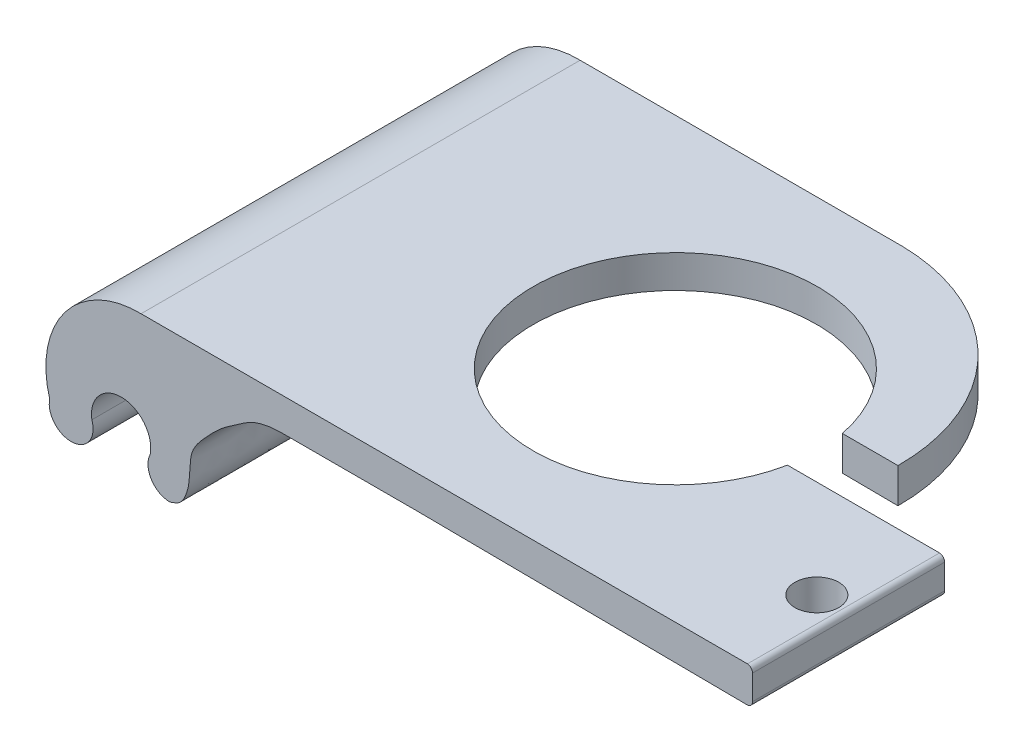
from build123d import *

# Parameters (mm, degrees)
EXTRUDE_1_DEPTH     = 40
SKETCH_2_R          = 2
CUT_EXTRUDE_1_DEPTH = 80.102041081


with BuildPart() as part:
    # Sketch 1 → Extrude 1 (new body)
    with BuildSketch(Plane.XY):
        with BuildLine():
            Line((-58.21529926, 13.518143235), (-2.967499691, 13.518143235))
            ThreePointArc((-2.967499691, 13.518143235), (-2.640223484, 13.358797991), (-2.507722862, 13.019763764))
            Line((-2.507722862, 13.019763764), (-2.507722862, 10.764939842))
            ThreePointArc((-2.507722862, 10.764939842), (-2.655707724, 10.409854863), (-3.012064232, 10.26495869))
            Line((-3.012064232, 10.26495869), (-33.0311513, 10.525616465))
            Line((-33.0311513, 10.525616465), (-45.539251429, 10.525616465))
            add(Edge.make_bspline(
                [(-45.539251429, 10.525616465), (-47.725259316, 10.445516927), (-48.539584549, 9.776731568), (-50.77500433, 8.2535315), (-51.435201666, 7.72180049), (-53.546493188, 5.323783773), (-53.761596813, 4.193924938), (-53.802592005, 2.539746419), (-53.999354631, 1.582962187), (-54.448557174, 0.2822606), (-55.326894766, 0.071697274), (-55.574899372, -0.025613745)],
                knots=[0, 0, 0, 0, 0.263204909, 0.312704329, 0.474739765, 0.506949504, 0.614547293, 0.712668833, 0.731664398, 0.804502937, 0.864132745, 0.864132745, 0.864132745, 0.864132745], degree=3))
            ThreePointArc((-55.574899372, -0.025613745), (-57.280291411, 0.917397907), (-57.373699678, 2.863909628))
            ThreePointArc((-57.373699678, 2.863909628), (-60.008596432, 6.041257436), (-62.696208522, 2.908373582))
            ThreePointArc((-62.696208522, 2.908373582), (-64.440027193, 0.248430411), (-66.543936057, 2.63375402))
            ThreePointArc((-66.543936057, 2.63375402), (-65.136178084, 10.185243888), (-58.21529926, 13.518143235))
        make_face()
    extrude(amount=EXTRUDE_1_DEPTH)

    # Sketch 2 → Cut-Extrude 1 (cut, through all)
    with BuildSketch(Plane.XZ.offset(-13.518143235)):
        with Locations(Location((-5.247655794, 31.402638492, 0), (0, 0, 180))):
            Circle(SKETCH_2_R)
        with BuildLine():
            Line((-2.507722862, 22.5), (-16.825407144, 22.5))
            ThreePointArc((-16.825407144, 22.5), (-42.496559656, 20), (-16.825407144, 17.5))
            Line((-16.825407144, 17.5), (-11.756818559, 17.5))
            ThreePointArc((-11.756818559, 17.5), (-16.7007081, 5.257797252), (-28.81141163, 0))
            Line((-28.81141163, 0), (-2.507722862, 0))
            Line((-2.507722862, 0), (-2.507722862, 22.5))
        make_face()
    extrude(amount=CUT_EXTRUDE_1_DEPTH, mode=Mode.SUBTRACT)


solid = part.part
